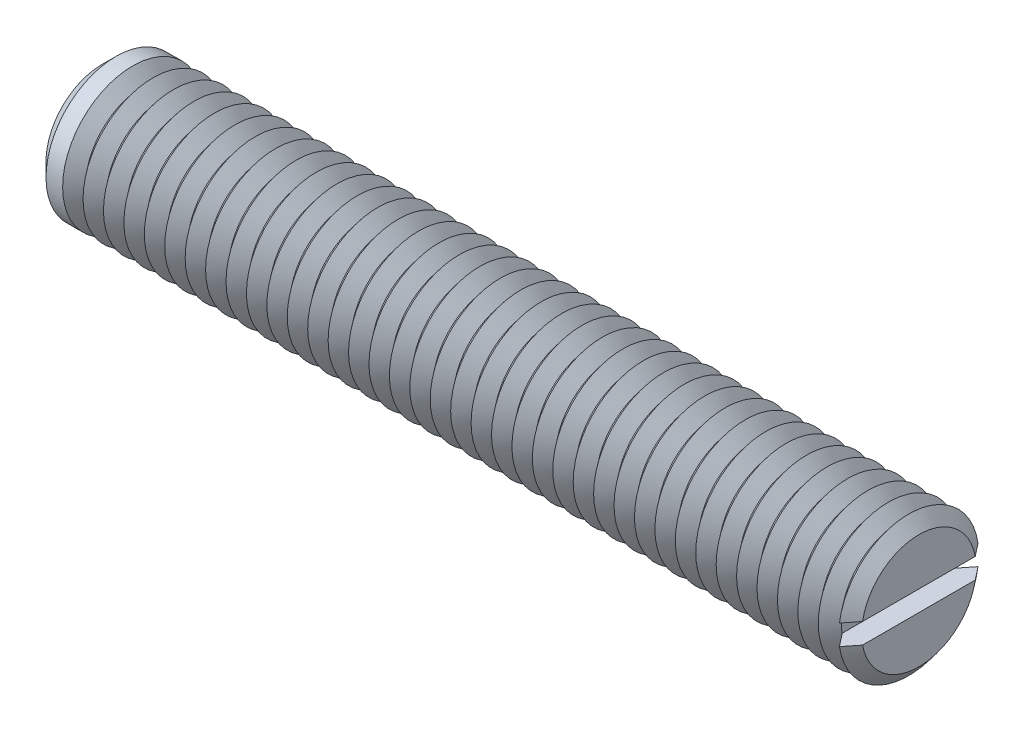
from build123d import *

# Parameters (mm, degrees)
SKETCH1_R       = 6
EXTRUDE1_DEPTH  = 35
SKETCH2_W       = 1.75
SKETCH2_H       = 1.75
EXTRUDE2_DEPTH  = 9
CHAMFER1_SIZE   = 1.2
LPATTERN1_COUNT = 39
LPATTERN1_PITCH = 1.75


with BuildPart() as part:
    # Sketch1 → Extrude1 (new, symmetric)
    with BuildSketch(Plane(origin=(0, 0, 0), x_dir=(0, 0, -1), z_dir=(1, 0, 0))):
        Circle(SKETCH1_R)
    extrude(amount=EXTRUDE1_DEPTH, both=True)

    # Sketch2 → Extrude2 (cut, symmetric)
    with BuildSketch(Plane.XY):
        with Locations((34.125, 0)):
            Rectangle(SKETCH2_W, SKETCH2_H)
    extrude(amount=EXTRUDE2_DEPTH, both=True, mode=Mode.SUBTRACT)

    # Chamfer1
    chamfer1_edges = [part.edges().sort_by_distance(p)[0] for p in [
        (-35, 0, 6),
    ]]
    chamfer(chamfer1_edges, length=CHAMFER1_SIZE)

    # Sketch3 → Cut-Revolve1 (revolve, cut)
    with BuildSketch(Plane.XY, mode=Mode.PRIVATE) as cut_revolve1_sk:
        Polygon((34.125, -6), (35.875, -6), (35, -4.90712535), align=None)
    cut_revolve1 = revolve(cut_revolve1_sk.sketch.rotate(Axis((0, 0, 0), (1, 0, 0)), 261.614461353), axis=Axis((0, 0, 0), (1, 0, 0)), mode=Mode.SUBTRACT)

    # LPattern1: Cut-Revolve1 ×39
    with Locations(*[(-i * LPATTERN1_PITCH, 0, 0) for i in range(1, LPATTERN1_COUNT)]):
        add(cut_revolve1, mode=Mode.SUBTRACT)


solid = part.part
